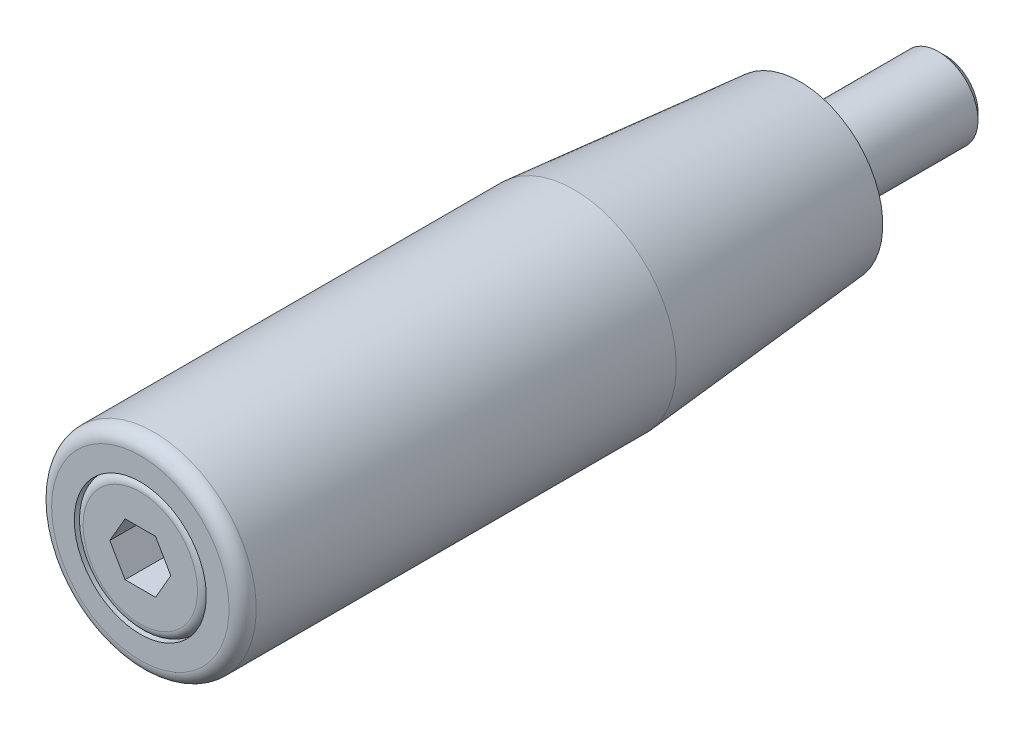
ISO-10303-21;
HEADER;
FILE_DESCRIPTION(('STEP AP214'),'2;1');
FILE_NAME('part.step','',(''),(''),'','','');
FILE_SCHEMA(('AUTOMOTIVE_DESIGN { 1 0 10303 214 1 1 1 1 }'));
ENDSEC;
DATA;
#1=APPLICATION_CONTEXT('core data for automotive mechanical design processes');
#2=APPLICATION_PROTOCOL_DEFINITION('international standard','automotive_design',2000,#1);
#3=PRODUCT_CONTEXT('',#1,'mechanical');
#4=PRODUCT('Part','Part','',(#3));
#5=PRODUCT_RELATED_PRODUCT_CATEGORY('part','',(#4));
#6=PRODUCT_DEFINITION_FORMATION('','',#4);
#7=PRODUCT_DEFINITION_CONTEXT('part definition',#1,'design');
#8=PRODUCT_DEFINITION('design','',#6,#7);
#9=PRODUCT_DEFINITION_SHAPE('','',#8);
#10=(LENGTH_UNIT() NAMED_UNIT(*) SI_UNIT(.MILLI.,.METRE.));
#11=(NAMED_UNIT(*) PLANE_ANGLE_UNIT() SI_UNIT($,.RADIAN.));
#12=(NAMED_UNIT(*) SI_UNIT($,.STERADIAN.) SOLID_ANGLE_UNIT());
#13=UNCERTAINTY_MEASURE_WITH_UNIT(LENGTH_MEASURE(1.E-05),#10,'distance_accuracy_value','');
#14=(GEOMETRIC_REPRESENTATION_CONTEXT(3) GLOBAL_UNCERTAINTY_ASSIGNED_CONTEXT((#13)) GLOBAL_UNIT_ASSIGNED_CONTEXT((#10,
#11,#12)) REPRESENTATION_CONTEXT('',''));
#15=CARTESIAN_POINT('',(0.,0.,0.));
#16=DIRECTION('',(0.,0.,1.));
#17=DIRECTION('',(1.,0.,0.));
#18=AXIS2_PLACEMENT_3D('',#15,#16,#17);
#19=CARTESIAN_POINT('',(0.,-5.,0.));
#20=DIRECTION('',(0.,0.,1.));
#21=DIRECTION('',(-1.,0.,0.));
#22=AXIS2_PLACEMENT_3D('',#19,#20,#21);
#23=PLANE('',#22);
#24=CARTESIAN_POINT('',(0.,0.,0.));
#25=DIRECTION('',(0.,0.,1.));
#26=DIRECTION('',(-1.,0.,0.));
#27=AXIS2_PLACEMENT_3D('',#24,#25,#26);
#28=CIRCLE('',#27,8.);
#29=CARTESIAN_POINT('',(-8.,0.,0.));
#30=VERTEX_POINT('',#29);
#31=EDGE_CURVE('E121',#30,#30,#28,.T.);
#32=ORIENTED_EDGE('',*,*,#31,.F.);
#33=EDGE_LOOP('',(#32));
#34=FACE_BOUND('',#33,.T.);
#35=CARTESIAN_POINT('',(0.,0.,0.));
#36=DIRECTION('',(0.,0.,1.));
#37=DIRECTION('',(-1.,0.,0.));
#38=AXIS2_PLACEMENT_3D('',#35,#36,#37);
#39=CIRCLE('',#38,5.);
#40=CARTESIAN_POINT('',(-5.,0.,0.));
#41=VERTEX_POINT('',#40);
#42=EDGE_CURVE('E124',#41,#41,#39,.T.);
#43=ORIENTED_EDGE('',*,*,#42,.T.);
#44=EDGE_LOOP('',(#43));
#45=FACE_BOUND('',#44,.T.);
#46=ADVANCED_FACE('F15',(#34,#45),#23,.F.);
#47=CARTESIAN_POINT('',(0.,-7.12262193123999E-13,102.));
#48=DIRECTION('',(0.,0.,1.));
#49=DIRECTION('',(-1.,0.,0.));
#50=AXIS2_PLACEMENT_3D('',#47,#48,#49);
#51=CYLINDRICAL_SURFACE('',#50,5.);
#52=ORIENTED_EDGE('',*,*,#42,.F.);
#53=EDGE_LOOP('',(#52));
#54=FACE_BOUND('',#53,.T.);
#55=CARTESIAN_POINT('',(0.,0.,-1.5));
#56=DIRECTION('',(0.,0.,1.));
#57=DIRECTION('',(-1.,0.,0.));
#58=AXIS2_PLACEMENT_3D('',#55,#56,#57);
#59=CIRCLE('',#58,5.);
#60=CARTESIAN_POINT('',(-5.,0.,-1.5));
#61=VERTEX_POINT('',#60);
#62=EDGE_CURVE('E127',#61,#61,#59,.T.);
#63=ORIENTED_EDGE('',*,*,#62,.T.);
#64=EDGE_LOOP('',(#63));
#65=FACE_BOUND('',#64,.T.);
#66=ADVANCED_FACE('F246',(#54,#65),#51,.T.);
#67=CARTESIAN_POINT('',(0.,-4.9265,-1.50000000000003));
#68=DIRECTION('',(0.,0.,1.));
#69=DIRECTION('',(-1.,0.,0.));
#70=AXIS2_PLACEMENT_3D('',#67,#68,#69);
#71=PLANE('',#70);
#72=ORIENTED_EDGE('',*,*,#62,.F.);
#73=EDGE_LOOP('',(#72));
#74=FACE_BOUND('',#73,.T.);
#75=CARTESIAN_POINT('',(0.,0.,-1.5));
#76=DIRECTION('',(0.,0.,1.));
#77=DIRECTION('',(-1.,0.,0.));
#78=AXIS2_PLACEMENT_3D('',#75,#76,#77);
#79=CIRCLE('',#78,4.9265);
#80=CARTESIAN_POINT('',(-4.9265,0.,-1.5));
#81=VERTEX_POINT('',#80);
#82=EDGE_CURVE('E130',#81,#81,#79,.T.);
#83=ORIENTED_EDGE('',*,*,#82,.T.);
#84=EDGE_LOOP('',(#83));
#85=FACE_BOUND('',#84,.T.);
#86=ADVANCED_FACE('F242',(#74,#85),#71,.F.);
#87=CARTESIAN_POINT('',(0.,0.,-2.5735));
#88=DIRECTION('',(0.,0.,-1.));
#89=DIRECTION('',(1.,0.,0.));
#90=AXIS2_PLACEMENT_3D('',#87,#88,#89);
#91=CONICAL_SURFACE('',#90,6.,0.785398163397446);
#92=ORIENTED_EDGE('',*,*,#82,.F.);
#93=EDGE_LOOP('',(#92));
#94=FACE_BOUND('',#93,.T.);
#95=CARTESIAN_POINT('',(0.,0.,-2.5735));
#96=DIRECTION('',(0.,0.,1.));
#97=DIRECTION('',(-1.,0.,0.));
#98=AXIS2_PLACEMENT_3D('',#95,#96,#97);
#99=CIRCLE('',#98,6.);
#100=CARTESIAN_POINT('',(-6.,0.,-2.5735));
#101=VERTEX_POINT('',#100);
#102=EDGE_CURVE('E133',#101,#101,#99,.T.);
#103=ORIENTED_EDGE('',*,*,#102,.T.);
#104=EDGE_LOOP('',(#103));
#105=FACE_BOUND('',#104,.T.);
#106=ADVANCED_FACE('F238',(#94,#105),#91,.T.);
#107=CARTESIAN_POINT('',(0.,-7.12262193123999E-13,102.));
#108=DIRECTION('',(0.,0.,1.));
#109=DIRECTION('',(-1.,0.,0.));
#110=AXIS2_PLACEMENT_3D('',#107,#108,#109);
#111=CYLINDRICAL_SURFACE('',#110,6.);
#112=ORIENTED_EDGE('',*,*,#102,.F.);
#113=EDGE_LOOP('',(#112));
#114=FACE_BOUND('',#113,.T.);
#115=CARTESIAN_POINT('',(0.,1.32163043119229E-13,-18.9265));
#116=DIRECTION('',(0.,0.,1.));
#117=DIRECTION('',(-1.,0.,0.));
#118=AXIS2_PLACEMENT_3D('',#115,#116,#117);
#119=CIRCLE('',#118,6.);
#120=CARTESIAN_POINT('',(-6.,1.32163043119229E-13,-18.9265));
#121=VERTEX_POINT('',#120);
#122=EDGE_CURVE('E136',#121,#121,#119,.T.);
#123=ORIENTED_EDGE('',*,*,#122,.T.);
#124=EDGE_LOOP('',(#123));
#125=FACE_BOUND('',#124,.T.);
#126=ADVANCED_FACE('F234',(#114,#125),#111,.T.);
#127=CARTESIAN_POINT('',(0.,1.39659253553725E-13,-20.));
#128=DIRECTION('',(0.,0.,1.));
#129=DIRECTION('',(-1.,0.,0.));
#130=AXIS2_PLACEMENT_3D('',#127,#128,#129);
#131=CONICAL_SURFACE('',#130,4.9265,0.785398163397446);
#132=ORIENTED_EDGE('',*,*,#122,.F.);
#133=EDGE_LOOP('',(#132));
#134=FACE_BOUND('',#133,.T.);
#135=CARTESIAN_POINT('',(0.,1.39659253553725E-13,-20.));
#136=DIRECTION('',(0.,0.,1.));
#137=DIRECTION('',(-1.,0.,0.));
#138=AXIS2_PLACEMENT_3D('',#135,#136,#137);
#139=CIRCLE('',#138,4.9265);
#140=CARTESIAN_POINT('',(-4.9265,1.39659253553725E-13,-20.));
#141=VERTEX_POINT('',#140);
#142=EDGE_CURVE('E139',#141,#141,#139,.T.);
#143=ORIENTED_EDGE('',*,*,#142,.T.);
#144=EDGE_LOOP('',(#143));
#145=FACE_BOUND('',#144,.T.);
#146=ADVANCED_FACE('F230',(#134,#145),#131,.T.);
#147=CARTESIAN_POINT('',(0.,1.39659253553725E-13,-20.));
#148=DIRECTION('',(0.,0.,1.));
#149=DIRECTION('',(-1.,0.,0.));
#150=AXIS2_PLACEMENT_3D('',#147,#148,#149);
#151=PLANE('',#150);
#152=ORIENTED_EDGE('',*,*,#142,.F.);
#153=EDGE_LOOP('',(#152));
#154=FACE_BOUND('',#153,.T.);
#155=ADVANCED_FACE('F202',(#154),#151,.F.);
#156=CARTESIAN_POINT('',(0.,-7.12262193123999E-13,102.));
#157=DIRECTION('',(0.,0.,1.));
#158=DIRECTION('',(-1.,0.,0.));
#159=AXIS2_PLACEMENT_3D('',#156,#157,#158);
#160=CYLINDRICAL_SURFACE('',#159,8.);
#161=CARTESIAN_POINT('',(0.,0.,2.));
#162=DIRECTION('',(0.,0.,-1.));
#163=DIRECTION('',(1.,0.,0.));
#164=AXIS2_PLACEMENT_3D('',#161,#162,#163);
#165=CIRCLE('',#164,8.);
#166=CARTESIAN_POINT('',(8.,0.,2.));
#167=VERTEX_POINT('',#166);
#168=EDGE_CURVE('E9',#167,#167,#165,.T.);
#169=ORIENTED_EDGE('',*,*,#168,.T.);
#170=EDGE_LOOP('',(#169));
#171=FACE_BOUND('',#170,.T.);
#172=ORIENTED_EDGE('',*,*,#31,.T.);
#173=EDGE_LOOP('',(#172));
#174=FACE_BOUND('',#173,.T.);
#175=ADVANCED_FACE('F194',(#171,#174),#160,.T.);
#176=CARTESIAN_POINT('',(0.,-7.12262193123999E-13,102.));
#177=DIRECTION('',(0.,0.,1.));
#178=DIRECTION('',(-1.,0.,0.));
#179=AXIS2_PLACEMENT_3D('',#176,#177,#178);
#180=CYLINDRICAL_SURFACE('',#179,10.);
#181=CARTESIAN_POINT('',(0.,-7.12262193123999E-13,102.));
#182=DIRECTION('',(0.,0.,1.));
#183=DIRECTION('',(-1.,0.,0.));
#184=AXIS2_PLACEMENT_3D('',#181,#182,#183);
#185=CIRCLE('',#184,10.);
#186=CARTESIAN_POINT('',(-10.,-7.12262193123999E-13,102.));
#187=VERTEX_POINT('',#186);
#188=EDGE_CURVE('E167',#187,#187,#185,.T.);
#189=ORIENTED_EDGE('',*,*,#188,.T.);
#190=EDGE_LOOP('',(#189));
#191=FACE_BOUND('',#190,.T.);
#192=CARTESIAN_POINT('',(0.,-7.02951576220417E-13,100.666666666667));
#193=DIRECTION('',(0.,0.,1.));
#194=DIRECTION('',(-1.,0.,0.));
#195=AXIS2_PLACEMENT_3D('',#192,#193,#194);
#196=CIRCLE('',#195,10.);
#197=CARTESIAN_POINT('',(-10.,-7.02951576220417E-13,100.666666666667));
#198=VERTEX_POINT('',#197);
#199=EDGE_CURVE('E112',#198,#198,#196,.T.);
#200=ORIENTED_EDGE('',*,*,#199,.F.);
#201=EDGE_LOOP('',(#200));
#202=FACE_BOUND('',#201,.T.);
#203=ADVANCED_FACE('F180',(#191,#202),#180,.F.);
#204=CARTESIAN_POINT('',(0.,-10.0000000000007,102.));
#205=DIRECTION('',(0.,0.,1.));
#206=DIRECTION('',(-1.,0.,0.));
#207=AXIS2_PLACEMENT_3D('',#204,#205,#206);
#208=PLANE('',#207);
#209=CARTESIAN_POINT('',(0.,-7.12262193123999E-13,102.));
#210=DIRECTION('',(0.,0.,1.));
#211=DIRECTION('',(-1.,0.,0.));
#212=AXIS2_PLACEMENT_3D('',#209,#210,#211);
#213=CIRCLE('',#212,13.4333333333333);
#214=CARTESIAN_POINT('',(-13.4333333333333,-7.12262193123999E-13,102.));
#215=VERTEX_POINT('',#214);
#216=EDGE_CURVE('E165',#215,#215,#213,.T.);
#217=ORIENTED_EDGE('',*,*,#216,.T.);
#218=EDGE_LOOP('',(#217));
#219=FACE_BOUND('',#218,.T.);
#220=ORIENTED_EDGE('',*,*,#188,.F.);
#221=EDGE_LOOP('',(#220));
#222=FACE_BOUND('',#221,.T.);
#223=ADVANCED_FACE('F211',(#219,#222),#208,.T.);
#224=CARTESIAN_POINT('',(0.,-6.97830736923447E-13,99.9333333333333));
#225=DIRECTION('',(0.,0.,1.));
#226=DIRECTION('',(-1.,0.,0.));
#227=AXIS2_PLACEMENT_3D('',#224,#225,#226);
#228=TOROIDAL_SURFACE('',#227,13.4333333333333,2.06666666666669);
#229=CARTESIAN_POINT('',(0.,-6.97830736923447E-13,99.9333333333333));
#230=DIRECTION('',(0.,0.,1.));
#231=DIRECTION('',(-1.,0.,0.));
#232=AXIS2_PLACEMENT_3D('',#229,#230,#231);
#233=CIRCLE('',#232,15.5);
#234=CARTESIAN_POINT('',(-15.5,-6.97830736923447E-13,99.9333333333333));
#235=VERTEX_POINT('',#234);
#236=EDGE_CURVE('E162',#235,#235,#233,.T.);
#237=ORIENTED_EDGE('',*,*,#236,.T.);
#238=EDGE_LOOP('',(#237));
#239=FACE_BOUND('',#238,.T.);
#240=ORIENTED_EDGE('',*,*,#216,.F.);
#241=EDGE_LOOP('',(#240));
#242=FACE_BOUND('',#241,.T.);
#243=ADVANCED_FACE('F214',(#239,#242),#228,.T.);
#244=CARTESIAN_POINT('',(0.,-12.5,1.99999999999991));
#245=DIRECTION('',(0.,0.,-1.));
#246=DIRECTION('',(1.,0.,0.));
#247=AXIS2_PLACEMENT_3D('',#244,#245,#246);
#248=PLANE('',#247);
#249=ORIENTED_EDGE('',*,*,#168,.F.);
#250=EDGE_LOOP('',(#249));
#251=FACE_BOUND('',#250,.T.);
#252=CARTESIAN_POINT('',(0.,0.,2.));
#253=DIRECTION('',(0.,0.,1.));
#254=DIRECTION('',(-1.,0.,0.));
#255=AXIS2_PLACEMENT_3D('',#252,#253,#254);
#256=CIRCLE('',#255,12.5);
#257=CARTESIAN_POINT('',(-12.5,0.,2.));
#258=VERTEX_POINT('',#257);
#259=EDGE_CURVE('E156',#258,#258,#256,.T.);
#260=ORIENTED_EDGE('',*,*,#259,.F.);
#261=EDGE_LOOP('',(#260));
#262=FACE_BOUND('',#261,.T.);
#263=ADVANCED_FACE('F17',(#251,#262),#248,.T.);
#264=CARTESIAN_POINT('',(0.,-2.53412811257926E-13,36.290156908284));
#265=DIRECTION('',(0.,0.,1.));
#266=DIRECTION('',(-1.,0.,0.));
#267=AXIS2_PLACEMENT_3D('',#264,#265,#266);
#268=CONICAL_SURFACE('',#267,15.5,0.0872664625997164);
#269=ORIENTED_EDGE('',*,*,#259,.T.);
#270=EDGE_LOOP('',(#269));
#271=FACE_BOUND('',#270,.T.);
#272=CARTESIAN_POINT('',(0.,-2.53412811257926E-13,36.290156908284));
#273=DIRECTION('',(0.,0.,1.));
#274=DIRECTION('',(-1.,0.,0.));
#275=AXIS2_PLACEMENT_3D('',#272,#273,#274);
#276=CIRCLE('',#275,15.5);
#277=CARTESIAN_POINT('',(-15.5,-2.53412811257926E-13,36.290156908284));
#278=VERTEX_POINT('',#277);
#279=EDGE_CURVE('E159',#278,#278,#276,.T.);
#280=ORIENTED_EDGE('',*,*,#279,.F.);
#281=EDGE_LOOP('',(#280));
#282=FACE_BOUND('',#281,.T.);
#283=ADVANCED_FACE('F223',(#271,#282),#268,.T.);
#284=CARTESIAN_POINT('',(0.,-7.12262193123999E-13,102.));
#285=DIRECTION('',(0.,0.,1.));
#286=DIRECTION('',(-1.,0.,0.));
#287=AXIS2_PLACEMENT_3D('',#284,#285,#286);
#288=CYLINDRICAL_SURFACE('',#287,15.5);
#289=ORIENTED_EDGE('',*,*,#279,.T.);
#290=EDGE_LOOP('',(#289));
#291=FACE_BOUND('',#290,.T.);
#292=ORIENTED_EDGE('',*,*,#236,.F.);
#293=EDGE_LOOP('',(#292));
#294=FACE_BOUND('',#293,.T.);
#295=ADVANCED_FACE('F219',(#291,#294),#288,.T.);
#296=CARTESIAN_POINT('',(0.,-7.02951576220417E-13,100.666666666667));
#297=DIRECTION('',(0.,0.,1.));
#298=DIRECTION('',(-1.,0.,0.));
#299=AXIS2_PLACEMENT_3D('',#296,#297,#298);
#300=TOROIDAL_SURFACE('',#299,8.66666666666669,1.33333333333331);
#301=ORIENTED_EDGE('',*,*,#199,.T.);
#302=EDGE_LOOP('',(#301));
#303=FACE_BOUND('',#302,.T.);
#304=CARTESIAN_POINT('',(0.,-7.12262193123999E-13,102.));
#305=DIRECTION('',(0.,0.,1.));
#306=DIRECTION('',(-1.,0.,0.));
#307=AXIS2_PLACEMENT_3D('',#304,#305,#306);
#308=CIRCLE('',#307,8.66666666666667);
#309=CARTESIAN_POINT('',(-8.66666666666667,-7.12262193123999E-13,102.));
#310=VERTEX_POINT('',#309);
#311=EDGE_CURVE('E85',#310,#310,#308,.T.);
#312=ORIENTED_EDGE('',*,*,#311,.F.);
#313=EDGE_LOOP('',(#312));
#314=FACE_BOUND('',#313,.T.);
#315=ADVANCED_FACE('F222',(#303,#314),#300,.T.);
#316=CARTESIAN_POINT('',(0.,-8.66666666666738,102.));
#317=DIRECTION('',(0.,0.,-1.));
#318=DIRECTION('',(1.,0.,0.));
#319=AXIS2_PLACEMENT_3D('',#316,#317,#318);
#320=PLANE('',#319);
#321=DIRECTION('',(1.,0.,0.));
#322=VECTOR('',#321,1.);
#323=CARTESIAN_POINT('',(0.,-4.00000000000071,102.));
#324=LINE('',#323,#322);
#325=CARTESIAN_POINT('',(-2.30940107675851,-4.00000000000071,102.));
#326=VERTEX_POINT('',#325);
#327=CARTESIAN_POINT('',(2.30940107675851,-4.00000000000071,102.));
#328=VERTEX_POINT('',#327);
#329=EDGE_CURVE('E146',#326,#328,#324,.T.);
#330=ORIENTED_EDGE('',*,*,#329,.F.);
#331=DIRECTION('',(0.5,-0.866025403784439,0.));
#332=VECTOR('',#331,1.);
#333=CARTESIAN_POINT('',(0.288675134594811,-8.50000000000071,102.));
#334=LINE('',#333,#332);
#335=CARTESIAN_POINT('',(-4.61880215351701,-7.12262193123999E-13,102.));
#336=VERTEX_POINT('',#335);
#337=EDGE_CURVE('E148',#336,#326,#334,.T.);
#338=ORIENTED_EDGE('',*,*,#337,.F.);
#339=DIRECTION('',(-0.5,-0.866025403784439,0.));
#340=VECTOR('',#339,1.);
#341=CARTESIAN_POINT('',(-7.21687836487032,-4.50000000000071,102.));
#342=LINE('',#341,#340);
#343=CARTESIAN_POINT('',(-2.30940107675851,3.99999999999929,102.));
#344=VERTEX_POINT('',#343);
#345=EDGE_CURVE('E151',#344,#336,#342,.T.);
#346=ORIENTED_EDGE('',*,*,#345,.F.);
#347=DIRECTION('',(-1.,0.,0.));
#348=VECTOR('',#347,1.);
#349=CARTESIAN_POINT('',(0.,3.99999999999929,102.));
#350=LINE('',#349,#348);
#351=CARTESIAN_POINT('',(2.30940107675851,3.99999999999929,102.));
#352=VERTEX_POINT('',#351);
#353=EDGE_CURVE('E41',#352,#344,#350,.T.);
#354=ORIENTED_EDGE('',*,*,#353,.F.);
#355=DIRECTION('',(-0.5,0.866025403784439,0.));
#356=VECTOR('',#355,1.);
#357=CARTESIAN_POINT('',(7.21687836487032,-4.50000000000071,102.));
#358=LINE('',#357,#356);
#359=CARTESIAN_POINT('',(4.61880215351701,-7.12262193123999E-13,102.));
#360=VERTEX_POINT('',#359);
#361=EDGE_CURVE('E142',#360,#352,#358,.T.);
#362=ORIENTED_EDGE('',*,*,#361,.F.);
#363=DIRECTION('',(0.5,0.866025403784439,0.));
#364=VECTOR('',#363,1.);
#365=CARTESIAN_POINT('',(-0.288675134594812,-8.50000000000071,102.));
#366=LINE('',#365,#364);
#367=EDGE_CURVE('E144',#328,#360,#366,.T.);
#368=ORIENTED_EDGE('',*,*,#367,.F.);
#369=EDGE_LOOP('',(#330,#338,#346,#354,#362,#368));
#370=FACE_BOUND('',#369,.T.);
#371=ORIENTED_EDGE('',*,*,#311,.T.);
#372=EDGE_LOOP('',(#371));
#373=FACE_BOUND('',#372,.T.);
#374=ADVANCED_FACE('F273',(#370,#373),#320,.F.);
#375=CARTESIAN_POINT('',(-2.30940107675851,-4.00000000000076,108.5));
#376=DIRECTION('',(0.,1.,0.));
#377=DIRECTION('',(-1.,0.,0.));
#378=AXIS2_PLACEMENT_3D('',#375,#376,#377);
#379=PLANE('',#378);
#380=DIRECTION('',(0.,0.,-1.));
#381=VECTOR('',#380,1.);
#382=CARTESIAN_POINT('',(-2.30940107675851,-4.00000000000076,108.5));
#383=LINE('',#382,#381);
#384=CARTESIAN_POINT('',(-2.30940107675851,-4.00000000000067,95.5));
#385=VERTEX_POINT('',#384);
#386=EDGE_CURVE('E106',#326,#385,#383,.T.);
#387=ORIENTED_EDGE('',*,*,#386,.F.);
#388=ORIENTED_EDGE('',*,*,#329,.T.);
#389=DIRECTION('',(0.,0.,-1.));
#390=VECTOR('',#389,1.);
#391=CARTESIAN_POINT('',(2.30940107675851,-4.00000000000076,108.5));
#392=LINE('',#391,#390);
#393=CARTESIAN_POINT('',(2.30940107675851,-4.00000000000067,95.5));
#394=VERTEX_POINT('',#393);
#395=EDGE_CURVE('E103',#328,#394,#392,.T.);
#396=ORIENTED_EDGE('',*,*,#395,.T.);
#397=DIRECTION('',(1.,0.,0.));
#398=VECTOR('',#397,1.);
#399=CARTESIAN_POINT('',(-2.30940107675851,-4.00000000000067,95.5));
#400=LINE('',#399,#398);
#401=EDGE_CURVE('E93',#385,#394,#400,.T.);
#402=ORIENTED_EDGE('',*,*,#401,.F.);
#403=EDGE_LOOP('',(#387,#388,#396,#402));
#404=FACE_BOUND('',#403,.T.);
#405=ADVANCED_FACE('F269',(#404),#379,.T.);
#406=CARTESIAN_POINT('',(-4.61880215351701,-7.5765145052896E-13,108.5));
#407=DIRECTION('',(0.866025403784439,0.5,0.));
#408=DIRECTION('',(-0.5,0.866025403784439,0.));
#409=AXIS2_PLACEMENT_3D('',#406,#407,#408);
#410=PLANE('',#409);
#411=ORIENTED_EDGE('',*,*,#337,.T.);
#412=ORIENTED_EDGE('',*,*,#386,.T.);
#413=DIRECTION('',(0.5,-0.866025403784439,0.));
#414=VECTOR('',#413,1.);
#415=CARTESIAN_POINT('',(-4.61880215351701,-6.66872935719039E-13,95.5));
#416=LINE('',#415,#414);
#417=CARTESIAN_POINT('',(-4.61880215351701,-6.66872935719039E-13,95.5));
#418=VERTEX_POINT('',#417);
#419=EDGE_CURVE('E91',#418,#385,#416,.T.);
#420=ORIENTED_EDGE('',*,*,#419,.F.);
#421=DIRECTION('',(0.,0.,-1.));
#422=VECTOR('',#421,1.);
#423=CARTESIAN_POINT('',(-4.61880215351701,-7.5765145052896E-13,108.5));
#424=LINE('',#423,#422);
#425=EDGE_CURVE('E86',#336,#418,#424,.T.);
#426=ORIENTED_EDGE('',*,*,#425,.F.);
#427=EDGE_LOOP('',(#411,#412,#420,#426));
#428=FACE_BOUND('',#427,.T.);
#429=ADVANCED_FACE('F272',(#428),#410,.T.);
#430=CARTESIAN_POINT('',(-2.30940107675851,3.99999999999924,108.5));
#431=DIRECTION('',(0.866025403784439,-0.5,0.));
#432=DIRECTION('',(0.5,0.866025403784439,0.));
#433=AXIS2_PLACEMENT_3D('',#430,#431,#432);
#434=PLANE('',#433);
#435=ORIENTED_EDGE('',*,*,#345,.T.);
#436=ORIENTED_EDGE('',*,*,#425,.T.);
#437=DIRECTION('',(-0.5,-0.866025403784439,0.));
#438=VECTOR('',#437,1.);
#439=CARTESIAN_POINT('',(-2.30940107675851,3.99999999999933,95.5));
#440=LINE('',#439,#438);
#441=CARTESIAN_POINT('',(-2.30940107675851,3.99999999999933,95.5));
#442=VERTEX_POINT('',#441);
#443=EDGE_CURVE('E76',#442,#418,#440,.T.);
#444=ORIENTED_EDGE('',*,*,#443,.F.);
#445=DIRECTION('',(0.,0.,-1.));
#446=VECTOR('',#445,1.);
#447=CARTESIAN_POINT('',(-2.30940107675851,3.99999999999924,108.5));
#448=LINE('',#447,#446);
#449=EDGE_CURVE('E81',#344,#442,#448,.T.);
#450=ORIENTED_EDGE('',*,*,#449,.F.);
#451=EDGE_LOOP('',(#435,#436,#444,#450));
#452=FACE_BOUND('',#451,.T.);
#453=ADVANCED_FACE('F88',(#452),#434,.T.);
#454=CARTESIAN_POINT('',(2.30940107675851,3.99999999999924,108.5));
#455=DIRECTION('',(0.,-1.,0.));
#456=DIRECTION('',(1.,0.,0.));
#457=AXIS2_PLACEMENT_3D('',#454,#455,#456);
#458=PLANE('',#457);
#459=ORIENTED_EDGE('',*,*,#353,.T.);
#460=ORIENTED_EDGE('',*,*,#449,.T.);
#461=DIRECTION('',(-1.,0.,0.));
#462=VECTOR('',#461,1.);
#463=CARTESIAN_POINT('',(2.30940107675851,3.99999999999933,95.5));
#464=LINE('',#463,#462);
#465=CARTESIAN_POINT('',(2.30940107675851,3.99999999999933,95.5));
#466=VERTEX_POINT('',#465);
#467=EDGE_CURVE('E73',#466,#442,#464,.T.);
#468=ORIENTED_EDGE('',*,*,#467,.F.);
#469=DIRECTION('',(0.,0.,-1.));
#470=VECTOR('',#469,1.);
#471=CARTESIAN_POINT('',(2.30940107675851,3.99999999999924,108.5));
#472=LINE('',#471,#470);
#473=EDGE_CURVE('E100',#352,#466,#472,.T.);
#474=ORIENTED_EDGE('',*,*,#473,.F.);
#475=EDGE_LOOP('',(#459,#460,#468,#474));
#476=FACE_BOUND('',#475,.T.);
#477=ADVANCED_FACE('F82',(#476),#458,.T.);
#478=CARTESIAN_POINT('',(4.61880215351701,-7.5765145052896E-13,108.5));
#479=DIRECTION('',(-0.866025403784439,-0.5,0.));
#480=DIRECTION('',(0.5,-0.866025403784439,0.));
#481=AXIS2_PLACEMENT_3D('',#478,#479,#480);
#482=PLANE('',#481);
#483=ORIENTED_EDGE('',*,*,#361,.T.);
#484=ORIENTED_EDGE('',*,*,#473,.T.);
#485=DIRECTION('',(-0.5,0.866025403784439,0.));
#486=VECTOR('',#485,1.);
#487=CARTESIAN_POINT('',(4.61880215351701,-6.66872935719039E-13,95.5));
#488=LINE('',#487,#486);
#489=CARTESIAN_POINT('',(4.61880215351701,-6.66872935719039E-13,95.5));
#490=VERTEX_POINT('',#489);
#491=EDGE_CURVE('E78',#490,#466,#488,.T.);
#492=ORIENTED_EDGE('',*,*,#491,.F.);
#493=DIRECTION('',(0.,0.,-1.));
#494=VECTOR('',#493,1.);
#495=CARTESIAN_POINT('',(4.61880215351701,-7.5765145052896E-13,108.5));
#496=LINE('',#495,#494);
#497=EDGE_CURVE('E33',#360,#490,#496,.T.);
#498=ORIENTED_EDGE('',*,*,#497,.F.);
#499=EDGE_LOOP('',(#483,#484,#492,#498));
#500=FACE_BOUND('',#499,.T.);
#501=ADVANCED_FACE('F263',(#500),#482,.T.);
#502=CARTESIAN_POINT('',(2.30940107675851,-4.00000000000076,108.5));
#503=DIRECTION('',(-0.866025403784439,0.5,0.));
#504=DIRECTION('',(-0.5,-0.866025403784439,0.));
#505=AXIS2_PLACEMENT_3D('',#502,#503,#504);
#506=PLANE('',#505);
#507=ORIENTED_EDGE('',*,*,#367,.T.);
#508=ORIENTED_EDGE('',*,*,#497,.T.);
#509=DIRECTION('',(0.5,0.866025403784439,0.));
#510=VECTOR('',#509,1.);
#511=CARTESIAN_POINT('',(2.30940107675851,-4.00000000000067,95.5));
#512=LINE('',#511,#510);
#513=EDGE_CURVE('E97',#394,#490,#512,.T.);
#514=ORIENTED_EDGE('',*,*,#513,.F.);
#515=ORIENTED_EDGE('',*,*,#395,.F.);
#516=EDGE_LOOP('',(#507,#508,#514,#515));
#517=FACE_BOUND('',#516,.T.);
#518=ADVANCED_FACE('F257',(#517),#506,.T.);
#519=CARTESIAN_POINT('',(0.,-6.66872935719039E-13,95.5));
#520=DIRECTION('',(0.,0.,1.));
#521=DIRECTION('',(-1.,0.,0.));
#522=AXIS2_PLACEMENT_3D('',#519,#520,#521);
#523=PLANE('',#522);
#524=ORIENTED_EDGE('',*,*,#419,.T.);
#525=ORIENTED_EDGE('',*,*,#401,.T.);
#526=ORIENTED_EDGE('',*,*,#513,.T.);
#527=ORIENTED_EDGE('',*,*,#491,.T.);
#528=ORIENTED_EDGE('',*,*,#467,.T.);
#529=ORIENTED_EDGE('',*,*,#443,.T.);
#530=EDGE_LOOP('',(#524,#525,#526,#527,#528,#529));
#531=FACE_BOUND('',#530,.T.);
#532=ADVANCED_FACE('F74',(#531),#523,.T.);
#533=CLOSED_SHELL('',(#46,#66,#86,#106,#126,#146,#155,#175,#203,#223,#243,#263,#283,#295,#315,
#374,#405,#429,#453,#477,#501,#518,#532));
#534=CARTESIAN_POINT('',(0.,-6.3544960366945E-13,91.));
#535=DIRECTION('',(0.,0.,1.));
#536=DIRECTION('',(-1.,0.,0.));
#537=AXIS2_PLACEMENT_3D('',#534,#535,#536);
#538=CIRCLE('',#537,8.);
#539=CARTESIAN_POINT('',(-8.,-6.3544960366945E-13,91.));
#540=VERTEX_POINT('',#539);
#541=EDGE_CURVE('E25',#540,#540,#538,.T.);
#542=ORIENTED_EDGE('',*,*,#541,.T.);
#543=EDGE_LOOP('',(#542));
#544=FACE_BOUND('',#543,.T.);
#545=CARTESIAN_POINT('',(0.,-6.37544492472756E-13,91.3));
#546=DIRECTION('',(0.,0.,1.));
#547=DIRECTION('',(-1.,0.,0.));
#548=AXIS2_PLACEMENT_3D('',#545,#546,#547);
#549=CIRCLE('',#548,8.);
#550=CARTESIAN_POINT('',(-8.,-6.37544492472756E-13,91.3));
#551=VERTEX_POINT('',#550);
#552=EDGE_CURVE('E118',#551,#551,#549,.T.);
#553=ORIENTED_EDGE('',*,*,#552,.F.);
#554=EDGE_LOOP('',(#553));
#555=FACE_BOUND('',#554,.T.);
#556=ADVANCED_FACE('F181',(#544,#555),#160,.T.);
#557=CARTESIAN_POINT('',(0.,-8.00000000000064,91.3));
#558=DIRECTION('',(0.,0.,1.));
#559=DIRECTION('',(-1.,0.,0.));
#560=AXIS2_PLACEMENT_3D('',#557,#558,#559);
#561=PLANE('',#560);
#562=CARTESIAN_POINT('',(0.,-6.37544492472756E-13,91.3));
#563=DIRECTION('',(0.,0.,1.));
#564=DIRECTION('',(-1.,0.,0.));
#565=AXIS2_PLACEMENT_3D('',#562,#563,#564);
#566=CIRCLE('',#565,10.);
#567=CARTESIAN_POINT('',(-10.,-6.37544492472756E-13,91.3));
#568=VERTEX_POINT('',#567);
#569=EDGE_CURVE('E115',#568,#568,#566,.T.);
#570=ORIENTED_EDGE('',*,*,#569,.F.);
#571=EDGE_LOOP('',(#570));
#572=FACE_BOUND('',#571,.T.);
#573=ORIENTED_EDGE('',*,*,#552,.T.);
#574=EDGE_LOOP('',(#573));
#575=FACE_BOUND('',#574,.T.);
#576=ADVANCED_FACE('F185',(#572,#575),#561,.F.);
#577=CARTESIAN_POINT('',(0.,-8.00000000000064,91.));
#578=DIRECTION('',(0.,0.,1.));
#579=DIRECTION('',(-1.,0.,0.));
#580=AXIS2_PLACEMENT_3D('',#577,#578,#579);
#581=PLANE('',#580);
#582=ORIENTED_EDGE('',*,*,#541,.F.);
#583=EDGE_LOOP('',(#582));
#584=FACE_BOUND('',#583,.T.);
#585=CARTESIAN_POINT('',(0.,-6.3544960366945E-13,91.));
#586=DIRECTION('',(0.,0.,1.));
#587=DIRECTION('',(-1.,0.,0.));
#588=AXIS2_PLACEMENT_3D('',#585,#586,#587);
#589=CIRCLE('',#588,10.);
#590=CARTESIAN_POINT('',(-10.,-6.3544960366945E-13,91.));
#591=VERTEX_POINT('',#590);
#592=EDGE_CURVE('E19',#591,#591,#589,.T.);
#593=ORIENTED_EDGE('',*,*,#592,.T.);
#594=EDGE_LOOP('',(#593));
#595=FACE_BOUND('',#594,.T.);
#596=ADVANCED_FACE('F174',(#584,#595),#581,.T.);
#597=ORIENTED_EDGE('',*,*,#592,.F.);
#598=EDGE_LOOP('',(#597));
#599=FACE_BOUND('',#598,.T.);
#600=ORIENTED_EDGE('',*,*,#569,.T.);
#601=EDGE_LOOP('',(#600));
#602=FACE_BOUND('',#601,.T.);
#603=ADVANCED_FACE('F176',(#599,#602),#180,.F.);
#604=CLOSED_SHELL('',(#556,#576,#596,#603));
#605=ORIENTED_CLOSED_SHELL('',*,#604,.T.);
#606=BREP_WITH_VOIDS('B1',#533,(#605));
#607=ADVANCED_BREP_SHAPE_REPRESENTATION('',(#18,#606),#14);
#608=SHAPE_DEFINITION_REPRESENTATION(#9,#607);
ENDSEC;
END-ISO-10303-21;
